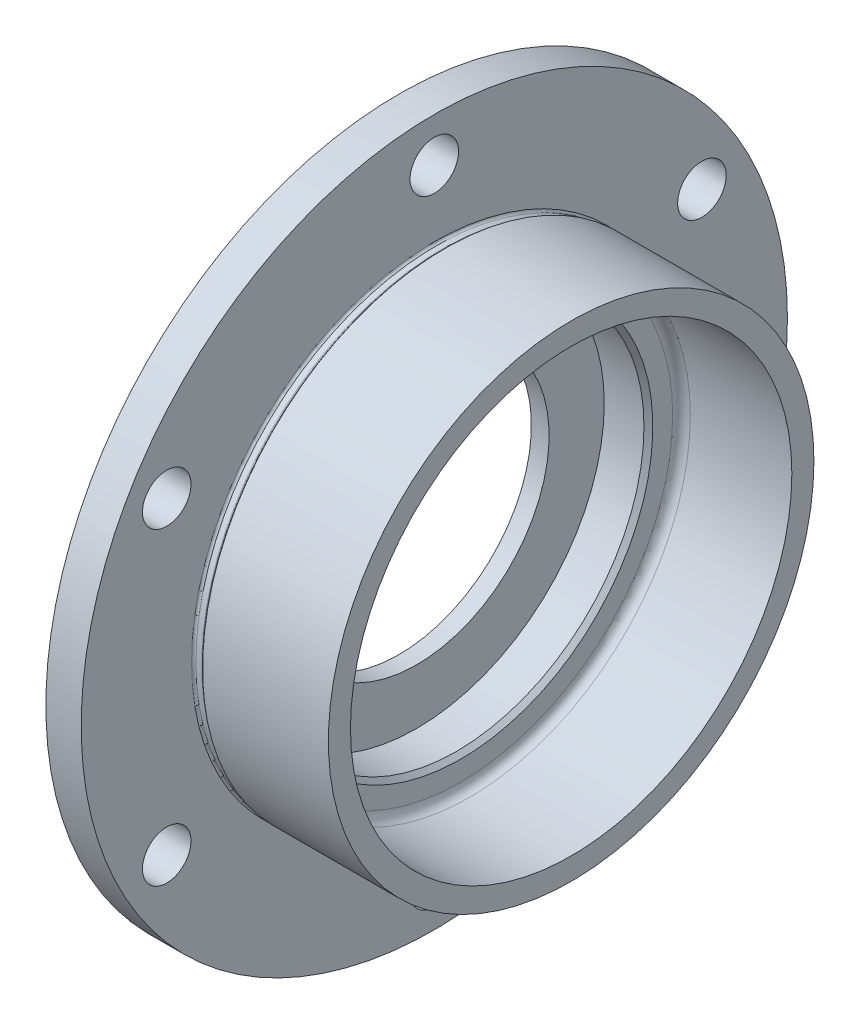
from build123d import *

# Parameters (mm, degrees)
FILLET2_R          = 0.5
CUT_EXTRUDE1_REACH = 121.67
SKETCH5_R          = 5.5
CIRPATTERN1_COUNT  = 6
CUT_EXTRUDE3_REACH = 121.67
SKETCH7_R          = 30
CHAMFER1_SIZE      = 1
FILLET3_R          = 2


with BuildPart() as part:
    # Sketch2 → Revolve1 (revolve)
    with BuildSketch(Plane.XY, mode=Mode.PRIVATE) as revolve1_sk:
        Polygon((0, 80), (0, 0), (4, 0), (4, 42.5), (14, 42.5), (14, 50), (39, 50), (39, 55), (8, 55), (8, 80), align=None)
    revolve(revolve1_sk.sketch.rotate(Axis((29.906992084, 0, 0), (-1, 0, 0)), 90), axis=Axis((29.906992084, 0, 0), (-1, 0, 0)))

    # Sketch3 → Cut-Revolve1 (revolve, cut)
    with BuildSketch(Plane.XY, mode=Mode.PRIVATE) as cut_revolve1_sk:
        Polygon((8, 55), (8, 54.5), (10, 54.5), (10.5, 55), align=None)
    revolve(cut_revolve1_sk.sketch.rotate(Axis((36.050630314, 0, 0), (-1, 0, 0)), 90), axis=Axis((36.050630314, 0, 0), (-1, 0, 0)), mode=Mode.SUBTRACT)

    # Fillet2
    fillet2_edges = [part.edges().sort_by_distance(p)[0] for p in [
        (8, 0, 54.5),
        (10, 0, 54.5),
    ]]
    fillet(fillet2_edges, radius=FILLET2_R)

    # Sketch5 → Cut-Extrude1 (cut, up to next)
    with BuildSketch(Plane.ZY, mode=Mode.PRIVATE) as cut_extrude1_sk1:
        with Locations((0, 70)):
            Circle(SKETCH5_R)
    cut_extrude1_tool1 = extrude(cut_extrude1_sk1.sketch, amount=-CUT_EXTRUDE1_REACH, mode=Mode.PRIVATE) & part.part
    cut_extrude1 = cut_extrude1_tool1.solids().sort_by_distance((0, 70, 0))[0]
    add(cut_extrude1, mode=Mode.SUBTRACT)

    # CirPattern1: Cut-Extrude1 ×6 about axis
    cirpattern1_axis = Axis((0, 0, 0), (1, 0, 0))
    for i in range(1, CIRPATTERN1_COUNT):
        add(cut_extrude1.rotate(cirpattern1_axis, i * 360 / CIRPATTERN1_COUNT), mode=Mode.SUBTRACT)

    # Sketch7 → Cut-Extrude3 (cut, up to next)
    with BuildSketch(Plane.ZY, mode=Mode.PRIVATE) as cut_extrude3_sk1:
        Circle(SKETCH7_R)
    cut_extrude3_tool1 = extrude(cut_extrude3_sk1.sketch, amount=-CUT_EXTRUDE3_REACH, mode=Mode.PRIVATE) & part.part
    add(cut_extrude3_tool1.solids().sort_by_distance((0, 0, 0))[0], mode=Mode.SUBTRACT)

    # Chamfer1
    chamfer1_edges = [part.edges().sort_by_distance(p)[0] for p in [
        (14, 0, 42.5),
    ]]
    chamfer(chamfer1_edges, length=CHAMFER1_SIZE)

    # Fillet3
    fillet3_edges = [part.edges().sort_by_distance(p)[0] for p in [
        (14, 0, 50),
    ]]
    fillet(fillet3_edges, radius=FILLET3_R)


solid = part.part
